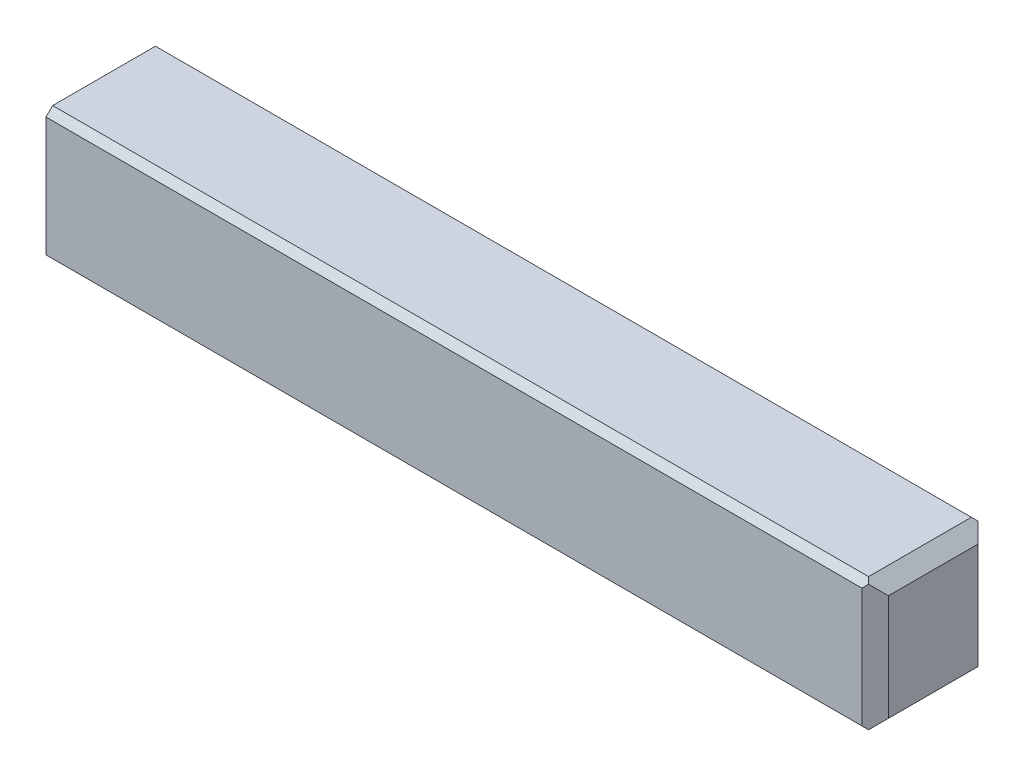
ISO-10303-21;
HEADER;
FILE_DESCRIPTION(('STEP AP214'),'2;1');
FILE_NAME('part.step','',(''),(''),'','','');
FILE_SCHEMA(('AUTOMOTIVE_DESIGN { 1 0 10303 214 1 1 1 1 }'));
ENDSEC;
DATA;
#1=APPLICATION_CONTEXT('core data for automotive mechanical design processes');
#2=APPLICATION_PROTOCOL_DEFINITION('international standard','automotive_design',2000,#1);
#3=PRODUCT_CONTEXT('',#1,'mechanical');
#4=PRODUCT('Part','Part','',(#3));
#5=PRODUCT_RELATED_PRODUCT_CATEGORY('part','',(#4));
#6=PRODUCT_DEFINITION_FORMATION('','',#4);
#7=PRODUCT_DEFINITION_CONTEXT('part definition',#1,'design');
#8=PRODUCT_DEFINITION('design','',#6,#7);
#9=PRODUCT_DEFINITION_SHAPE('','',#8);
#10=(LENGTH_UNIT() NAMED_UNIT(*) SI_UNIT(.MILLI.,.METRE.));
#11=(NAMED_UNIT(*) PLANE_ANGLE_UNIT() SI_UNIT($,.RADIAN.));
#12=(NAMED_UNIT(*) SI_UNIT($,.STERADIAN.) SOLID_ANGLE_UNIT());
#13=UNCERTAINTY_MEASURE_WITH_UNIT(LENGTH_MEASURE(1.E-05),#10,'distance_accuracy_value','');
#14=(GEOMETRIC_REPRESENTATION_CONTEXT(3) GLOBAL_UNCERTAINTY_ASSIGNED_CONTEXT((#13)) GLOBAL_UNIT_ASSIGNED_CONTEXT((#10,
#11,#12)) REPRESENTATION_CONTEXT('',''));
#15=CARTESIAN_POINT('',(0.,0.,0.));
#16=DIRECTION('',(0.,0.,1.));
#17=DIRECTION('',(1.,0.,0.));
#18=AXIS2_PLACEMENT_3D('',#15,#16,#17);
#19=CARTESIAN_POINT('',(-50.,3.6,-3.5));
#20=DIRECTION('',(0.,0.707106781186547,-0.707106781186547));
#21=DIRECTION('',(0.,0.707106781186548,0.707106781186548));
#22=AXIS2_PLACEMENT_3D('',#19,#20,#21);
#23=PLANE('',#22);
#24=DIRECTION('',(-0.577350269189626,0.577350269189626,0.577350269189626));
#25=VECTOR('',#24,1.);
#26=CARTESIAN_POINT('',(-16.9333333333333,20.1333333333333,13.0333333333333));
#27=LINE('',#26,#25);
#28=CARTESIAN_POINT('',(-0.800000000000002,4.,-3.1));
#29=VERTEX_POINT('',#28);
#30=CARTESIAN_POINT('',(-0.600000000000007,3.8,-3.29999999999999));
#31=VERTEX_POINT('',#30);
#32=EDGE_CURVE('E219',#29,#31,#27,.F.);
#33=ORIENTED_EDGE('',*,*,#32,.T.);
#34=DIRECTION('',(0.577350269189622,0.577350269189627,0.577350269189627));
#35=VECTOR('',#34,1.);
#36=CARTESIAN_POINT('',(-17.1999999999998,-12.8,-19.9));
#37=LINE('',#36,#35);
#38=CARTESIAN_POINT('',(-0.800000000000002,3.6,-3.5));
#39=VERTEX_POINT('',#38);
#40=EDGE_CURVE('E222',#31,#39,#37,.F.);
#41=ORIENTED_EDGE('',*,*,#40,.T.);
#42=DIRECTION('',(1.,0.,0.));
#43=VECTOR('',#42,1.);
#44=CARTESIAN_POINT('',(-50.,3.6,-3.5));
#45=LINE('',#44,#43);
#46=CARTESIAN_POINT('',(-50.,3.6,-3.5));
#47=VERTEX_POINT('',#46);
#48=EDGE_CURVE('E156',#47,#39,#45,.T.);
#49=ORIENTED_EDGE('',*,*,#48,.F.);
#50=DIRECTION('',(0.,0.707106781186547,0.707106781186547));
#51=VECTOR('',#50,1.);
#52=CARTESIAN_POINT('',(-50.,3.6,-3.5));
#53=LINE('',#52,#51);
#54=CARTESIAN_POINT('',(-50.,4.,-3.1));
#55=VERTEX_POINT('',#54);
#56=EDGE_CURVE('E148',#47,#55,#53,.T.);
#57=ORIENTED_EDGE('',*,*,#56,.T.);
#58=DIRECTION('',(1.,0.,0.));
#59=VECTOR('',#58,1.);
#60=CARTESIAN_POINT('',(-50.,4.,-3.1));
#61=LINE('',#60,#59);
#62=EDGE_CURVE('E131',#55,#29,#61,.T.);
#63=ORIENTED_EDGE('',*,*,#62,.T.);
#64=EDGE_LOOP('',(#33,#41,#49,#57,#63));
#65=FACE_BOUND('',#64,.T.);
#66=ADVANCED_FACE('F40',(#65),#23,.T.);
#67=CARTESIAN_POINT('',(-50.,-3.6,-3.5));
#68=DIRECTION('',(0.,0.,-1.));
#69=DIRECTION('',(-1.,0.,0.));
#70=AXIS2_PLACEMENT_3D('',#67,#68,#69);
#71=PLANE('',#70);
#72=ORIENTED_EDGE('',*,*,#48,.T.);
#73=DIRECTION('',(0.,-1.,0.));
#74=VECTOR('',#73,1.);
#75=CARTESIAN_POINT('',(-0.800000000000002,-3.6,-3.5));
#76=LINE('',#75,#74);
#77=CARTESIAN_POINT('',(-0.800000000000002,-3.6,-3.5));
#78=VERTEX_POINT('',#77);
#79=EDGE_CURVE('E225',#39,#78,#76,.T.);
#80=ORIENTED_EDGE('',*,*,#79,.T.);
#81=DIRECTION('',(1.,0.,0.));
#82=VECTOR('',#81,1.);
#83=CARTESIAN_POINT('',(-50.,-3.6,-3.5));
#84=LINE('',#83,#82);
#85=CARTESIAN_POINT('',(-50.,-3.6,-3.5));
#86=VERTEX_POINT('',#85);
#87=EDGE_CURVE('E186',#86,#78,#84,.T.);
#88=ORIENTED_EDGE('',*,*,#87,.F.);
#89=DIRECTION('',(0.,1.,0.));
#90=VECTOR('',#89,1.);
#91=CARTESIAN_POINT('',(-50.,-3.6,-3.5));
#92=LINE('',#91,#90);
#93=EDGE_CURVE('E141',#86,#47,#92,.T.);
#94=ORIENTED_EDGE('',*,*,#93,.T.);
#95=EDGE_LOOP('',(#72,#80,#88,#94));
#96=FACE_BOUND('',#95,.T.);
#97=ADVANCED_FACE('F278',(#96),#71,.T.);
#98=CARTESIAN_POINT('',(-50.,-4.,-3.1));
#99=DIRECTION('',(0.,-0.707106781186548,-0.707106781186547));
#100=DIRECTION('',(0.,0.707106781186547,-0.707106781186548));
#101=AXIS2_PLACEMENT_3D('',#98,#99,#100);
#102=PLANE('',#101);
#103=ORIENTED_EDGE('',*,*,#87,.T.);
#104=DIRECTION('',(-0.577350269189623,0.577350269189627,-0.577350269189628));
#105=VECTOR('',#104,1.);
#106=CARTESIAN_POINT('',(-16.9333333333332,12.5333333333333,-19.6333333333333));
#107=LINE('',#106,#105);
#108=CARTESIAN_POINT('',(-0.600000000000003,-3.8,-3.29999999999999));
#109=VERTEX_POINT('',#108);
#110=EDGE_CURVE('E232',#78,#109,#107,.F.);
#111=ORIENTED_EDGE('',*,*,#110,.T.);
#112=DIRECTION('',(0.577350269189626,0.577350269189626,-0.577350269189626));
#113=VECTOR('',#112,1.);
#114=CARTESIAN_POINT('',(-17.2,-20.4,13.3));
#115=LINE('',#114,#113);
#116=CARTESIAN_POINT('',(-0.800000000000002,-4.,-3.1));
#117=VERTEX_POINT('',#116);
#118=EDGE_CURVE('E229',#109,#117,#115,.F.);
#119=ORIENTED_EDGE('',*,*,#118,.T.);
#120=DIRECTION('',(1.,0.,0.));
#121=VECTOR('',#120,1.);
#122=CARTESIAN_POINT('',(-50.,-4.,-3.1));
#123=LINE('',#122,#121);
#124=CARTESIAN_POINT('',(-50.,-4.,-3.1));
#125=VERTEX_POINT('',#124);
#126=EDGE_CURVE('E190',#125,#117,#123,.T.);
#127=ORIENTED_EDGE('',*,*,#126,.F.);
#128=DIRECTION('',(0.,0.707106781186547,-0.707106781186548));
#129=VECTOR('',#128,1.);
#130=CARTESIAN_POINT('',(-50.,-4.,-3.1));
#131=LINE('',#130,#129);
#132=EDGE_CURVE('E177',#125,#86,#131,.T.);
#133=ORIENTED_EDGE('',*,*,#132,.T.);
#134=EDGE_LOOP('',(#103,#111,#119,#127,#133));
#135=FACE_BOUND('',#134,.T.);
#136=ADVANCED_FACE('F281',(#135),#102,.T.);
#137=CARTESIAN_POINT('',(-50.,-4.,3.1));
#138=DIRECTION('',(0.,-1.,0.));
#139=DIRECTION('',(0.,0.,-1.));
#140=AXIS2_PLACEMENT_3D('',#137,#138,#139);
#141=PLANE('',#140);
#142=ORIENTED_EDGE('',*,*,#126,.T.);
#143=DIRECTION('',(0.,0.,1.));
#144=VECTOR('',#143,1.);
#145=CARTESIAN_POINT('',(-0.800000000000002,-4.,3.1));
#146=LINE('',#145,#144);
#147=CARTESIAN_POINT('',(-0.800000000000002,-4.,3.1));
#148=VERTEX_POINT('',#147);
#149=EDGE_CURVE('E235',#117,#148,#146,.T.);
#150=ORIENTED_EDGE('',*,*,#149,.T.);
#151=DIRECTION('',(1.,0.,0.));
#152=VECTOR('',#151,1.);
#153=CARTESIAN_POINT('',(-50.,-4.,3.1));
#154=LINE('',#153,#152);
#155=CARTESIAN_POINT('',(-50.,-4.,3.1));
#156=VERTEX_POINT('',#155);
#157=EDGE_CURVE('E194',#156,#148,#154,.T.);
#158=ORIENTED_EDGE('',*,*,#157,.F.);
#159=DIRECTION('',(0.,0.,-1.));
#160=VECTOR('',#159,1.);
#161=CARTESIAN_POINT('',(-50.,-4.,3.1));
#162=LINE('',#161,#160);
#163=EDGE_CURVE('E173',#156,#125,#162,.T.);
#164=ORIENTED_EDGE('',*,*,#163,.T.);
#165=EDGE_LOOP('',(#142,#150,#158,#164));
#166=FACE_BOUND('',#165,.T.);
#167=ADVANCED_FACE('F287',(#166),#141,.T.);
#168=CARTESIAN_POINT('',(-50.,-3.6,3.5));
#169=DIRECTION('',(0.,-0.707106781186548,0.707106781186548));
#170=DIRECTION('',(0.,-0.707106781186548,-0.707106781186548));
#171=AXIS2_PLACEMENT_3D('',#168,#169,#170);
#172=PLANE('',#171);
#173=ORIENTED_EDGE('',*,*,#157,.T.);
#174=DIRECTION('',(-0.577350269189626,-0.577350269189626,-0.577350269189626));
#175=VECTOR('',#174,1.);
#176=CARTESIAN_POINT('',(-16.9333333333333,-20.1333333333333,-13.0333333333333));
#177=LINE('',#176,#175);
#178=CARTESIAN_POINT('',(-0.600000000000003,-3.8,3.3));
#179=VERTEX_POINT('',#178);
#180=EDGE_CURVE('E241',#148,#179,#177,.F.);
#181=ORIENTED_EDGE('',*,*,#180,.T.);
#182=DIRECTION('',(0.577350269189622,-0.577350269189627,-0.577350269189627));
#183=VECTOR('',#182,1.);
#184=CARTESIAN_POINT('',(-17.1999999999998,12.8,19.9));
#185=LINE('',#184,#183);
#186=CARTESIAN_POINT('',(-0.800000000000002,-3.6,3.5));
#187=VERTEX_POINT('',#186);
#188=EDGE_CURVE('E238',#179,#187,#185,.F.);
#189=ORIENTED_EDGE('',*,*,#188,.T.);
#190=DIRECTION('',(1.,0.,0.));
#191=VECTOR('',#190,1.);
#192=CARTESIAN_POINT('',(-50.,-3.6,3.5));
#193=LINE('',#192,#191);
#194=CARTESIAN_POINT('',(-50.,-3.6,3.5));
#195=VERTEX_POINT('',#194);
#196=EDGE_CURVE('E198',#195,#187,#193,.T.);
#197=ORIENTED_EDGE('',*,*,#196,.F.);
#198=DIRECTION('',(0.,-0.707106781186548,-0.707106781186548));
#199=VECTOR('',#198,1.);
#200=CARTESIAN_POINT('',(-50.,-3.6,3.5));
#201=LINE('',#200,#199);
#202=EDGE_CURVE('E169',#195,#156,#201,.T.);
#203=ORIENTED_EDGE('',*,*,#202,.T.);
#204=EDGE_LOOP('',(#173,#181,#189,#197,#203));
#205=FACE_BOUND('',#204,.T.);
#206=ADVANCED_FACE('F290',(#205),#172,.T.);
#207=CARTESIAN_POINT('',(-50.,3.6,3.5));
#208=DIRECTION('',(0.,0.,1.));
#209=DIRECTION('',(1.,0.,0.));
#210=AXIS2_PLACEMENT_3D('',#207,#208,#209);
#211=PLANE('',#210);
#212=ORIENTED_EDGE('',*,*,#196,.T.);
#213=DIRECTION('',(0.,1.,0.));
#214=VECTOR('',#213,1.);
#215=CARTESIAN_POINT('',(-0.800000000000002,3.6,3.5));
#216=LINE('',#215,#214);
#217=CARTESIAN_POINT('',(-0.800000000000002,3.6,3.5));
#218=VERTEX_POINT('',#217);
#219=EDGE_CURVE('E244',#187,#218,#216,.T.);
#220=ORIENTED_EDGE('',*,*,#219,.T.);
#221=DIRECTION('',(1.,0.,0.));
#222=VECTOR('',#221,1.);
#223=CARTESIAN_POINT('',(-50.,3.6,3.5));
#224=LINE('',#223,#222);
#225=CARTESIAN_POINT('',(-50.,3.6,3.5));
#226=VERTEX_POINT('',#225);
#227=EDGE_CURVE('E202',#226,#218,#224,.T.);
#228=ORIENTED_EDGE('',*,*,#227,.F.);
#229=DIRECTION('',(0.,-1.,0.));
#230=VECTOR('',#229,1.);
#231=CARTESIAN_POINT('',(-50.,3.6,3.5));
#232=LINE('',#231,#230);
#233=EDGE_CURVE('E165',#226,#195,#232,.T.);
#234=ORIENTED_EDGE('',*,*,#233,.T.);
#235=EDGE_LOOP('',(#212,#220,#228,#234));
#236=FACE_BOUND('',#235,.T.);
#237=ADVANCED_FACE('F294',(#236),#211,.T.);
#238=CARTESIAN_POINT('',(-50.,4.,3.1));
#239=DIRECTION('',(0.,0.707106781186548,0.707106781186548));
#240=DIRECTION('',(0.,-0.707106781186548,0.707106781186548));
#241=AXIS2_PLACEMENT_3D('',#238,#239,#240);
#242=PLANE('',#241);
#243=ORIENTED_EDGE('',*,*,#227,.T.);
#244=DIRECTION('',(-0.577350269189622,-0.577350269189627,0.577350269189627));
#245=VECTOR('',#244,1.);
#246=CARTESIAN_POINT('',(-16.9333333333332,-12.5333333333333,19.6333333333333));
#247=LINE('',#246,#245);
#248=CARTESIAN_POINT('',(-0.600000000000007,3.8,3.3));
#249=VERTEX_POINT('',#248);
#250=EDGE_CURVE('E51',#218,#249,#247,.F.);
#251=ORIENTED_EDGE('',*,*,#250,.T.);
#252=DIRECTION('',(0.577350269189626,-0.577350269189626,0.577350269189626));
#253=VECTOR('',#252,1.);
#254=CARTESIAN_POINT('',(-17.2,20.4,-13.3));
#255=LINE('',#254,#253);
#256=CARTESIAN_POINT('',(-0.800000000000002,4.,3.1));
#257=VERTEX_POINT('',#256);
#258=EDGE_CURVE('E63',#249,#257,#255,.F.);
#259=ORIENTED_EDGE('',*,*,#258,.T.);
#260=DIRECTION('',(1.,0.,0.));
#261=VECTOR('',#260,1.);
#262=CARTESIAN_POINT('',(-50.,4.,3.1));
#263=LINE('',#262,#261);
#264=CARTESIAN_POINT('',(-50.,4.,3.1));
#265=VERTEX_POINT('',#264);
#266=EDGE_CURVE('E140',#265,#257,#263,.T.);
#267=ORIENTED_EDGE('',*,*,#266,.F.);
#268=DIRECTION('',(0.,-0.707106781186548,0.707106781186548));
#269=VECTOR('',#268,1.);
#270=CARTESIAN_POINT('',(-50.,4.,3.1));
#271=LINE('',#270,#269);
#272=EDGE_CURVE('E152',#265,#226,#271,.T.);
#273=ORIENTED_EDGE('',*,*,#272,.T.);
#274=EDGE_LOOP('',(#243,#251,#259,#267,#273));
#275=FACE_BOUND('',#274,.T.);
#276=ADVANCED_FACE('F295',(#275),#242,.T.);
#277=CARTESIAN_POINT('',(-50.,4.,-3.1));
#278=DIRECTION('',(0.,1.,0.));
#279=DIRECTION('',(0.,0.,1.));
#280=AXIS2_PLACEMENT_3D('',#277,#278,#279);
#281=PLANE('',#280);
#282=ORIENTED_EDGE('',*,*,#266,.T.);
#283=DIRECTION('',(0.,0.,-1.));
#284=VECTOR('',#283,1.);
#285=CARTESIAN_POINT('',(-0.800000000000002,4.,-3.1));
#286=LINE('',#285,#284);
#287=EDGE_CURVE('E11',#257,#29,#286,.T.);
#288=ORIENTED_EDGE('',*,*,#287,.T.);
#289=ORIENTED_EDGE('',*,*,#62,.F.);
#290=DIRECTION('',(0.,0.,1.));
#291=VECTOR('',#290,1.);
#292=CARTESIAN_POINT('',(-50.,4.,-3.1));
#293=LINE('',#292,#291);
#294=EDGE_CURVE('E134',#55,#265,#293,.T.);
#295=ORIENTED_EDGE('',*,*,#294,.T.);
#296=EDGE_LOOP('',(#282,#288,#289,#295));
#297=FACE_BOUND('',#296,.T.);
#298=ADVANCED_FACE('F133',(#297),#281,.T.);
#299=CARTESIAN_POINT('',(-50.,0.,0.));
#300=DIRECTION('',(1.,0.,0.));
#301=DIRECTION('',(0.,0.,-1.));
#302=AXIS2_PLACEMENT_3D('',#299,#300,#301);
#303=PLANE('',#302);
#304=ORIENTED_EDGE('',*,*,#56,.F.);
#305=ORIENTED_EDGE('',*,*,#93,.F.);
#306=ORIENTED_EDGE('',*,*,#132,.F.);
#307=ORIENTED_EDGE('',*,*,#163,.F.);
#308=ORIENTED_EDGE('',*,*,#202,.F.);
#309=ORIENTED_EDGE('',*,*,#233,.F.);
#310=ORIENTED_EDGE('',*,*,#272,.F.);
#311=ORIENTED_EDGE('',*,*,#294,.F.);
#312=EDGE_LOOP('',(#304,#305,#306,#307,#308,#309,#310,#311));
#313=FACE_BOUND('',#312,.T.);
#314=ADVANCED_FACE('F146',(#313),#303,.F.);
#315=CARTESIAN_POINT('',(0.,0.,0.));
#316=DIRECTION('',(1.,0.,0.));
#317=DIRECTION('',(0.,0.,-1.));
#318=AXIS2_PLACEMENT_3D('',#315,#316,#317);
#319=PLANE('',#318);
#320=DIRECTION('',(0.,0.,-1.));
#321=VECTOR('',#320,1.);
#322=CARTESIAN_POINT('',(0.,-3.2,0.));
#323=LINE('',#322,#321);
#324=CARTESIAN_POINT('',(0.,-3.2,2.69999999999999));
#325=VERTEX_POINT('',#324);
#326=CARTESIAN_POINT('',(0.,-3.2,-2.69999999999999));
#327=VERTEX_POINT('',#326);
#328=EDGE_CURVE('E212',#325,#327,#323,.T.);
#329=ORIENTED_EDGE('',*,*,#328,.T.);
#330=DIRECTION('',(0.,1.,0.));
#331=VECTOR('',#330,1.);
#332=CARTESIAN_POINT('',(0.,0.,-2.69999999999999));
#333=LINE('',#332,#331);
#334=CARTESIAN_POINT('',(0.,3.2,-2.69999999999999));
#335=VERTEX_POINT('',#334);
#336=EDGE_CURVE('E215',#327,#335,#333,.T.);
#337=ORIENTED_EDGE('',*,*,#336,.T.);
#338=DIRECTION('',(0.,0.,1.));
#339=VECTOR('',#338,1.);
#340=CARTESIAN_POINT('',(0.,3.2,0.));
#341=LINE('',#340,#339);
#342=CARTESIAN_POINT('',(0.,3.2,2.69999999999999));
#343=VERTEX_POINT('',#342);
#344=EDGE_CURVE('E185',#335,#343,#341,.T.);
#345=ORIENTED_EDGE('',*,*,#344,.T.);
#346=DIRECTION('',(0.,-1.,0.));
#347=VECTOR('',#346,1.);
#348=CARTESIAN_POINT('',(0.,0.,2.69999999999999));
#349=LINE('',#348,#347);
#350=EDGE_CURVE('E209',#343,#325,#349,.T.);
#351=ORIENTED_EDGE('',*,*,#350,.T.);
#352=EDGE_LOOP('',(#329,#337,#345,#351));
#353=FACE_BOUND('',#352,.T.);
#354=ADVANCED_FACE('F270',(#353),#319,.T.);
#355=CARTESIAN_POINT('',(0.,0.,2.69999999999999));
#356=DIRECTION('',(-0.707106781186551,0.,-0.707106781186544));
#357=DIRECTION('',(0.,-1.,0.));
#358=AXIS2_PLACEMENT_3D('',#355,#356,#357);
#359=PLANE('',#358);
#360=ORIENTED_EDGE('',*,*,#219,.F.);
#361=ORIENTED_EDGE('',*,*,#188,.F.);
#362=DIRECTION('',(-0.577350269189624,-0.577350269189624,0.577350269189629));
#363=VECTOR('',#362,1.);
#364=CARTESIAN_POINT('',(0.9,-2.3,1.79999999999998));
#365=LINE('',#364,#363);
#366=EDGE_CURVE('E45',#325,#179,#365,.T.);
#367=ORIENTED_EDGE('',*,*,#366,.F.);
#368=ORIENTED_EDGE('',*,*,#350,.F.);
#369=DIRECTION('',(-0.577350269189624,0.577350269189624,0.577350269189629));
#370=VECTOR('',#369,1.);
#371=CARTESIAN_POINT('',(1.06666666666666,2.13333333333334,1.63333333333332));
#372=LINE('',#371,#370);
#373=EDGE_CURVE('E161',#249,#343,#372,.F.);
#374=ORIENTED_EDGE('',*,*,#373,.F.);
#375=ORIENTED_EDGE('',*,*,#250,.F.);
#376=EDGE_LOOP('',(#360,#361,#367,#368,#374,#375));
#377=FACE_BOUND('',#376,.T.);
#378=ADVANCED_FACE('F43',(#377),#359,.F.);
#379=CARTESIAN_POINT('',(0.,-3.2,0.));
#380=DIRECTION('',(-0.707106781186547,0.707106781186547,0.));
#381=DIRECTION('',(0.,0.,-1.));
#382=AXIS2_PLACEMENT_3D('',#379,#380,#381);
#383=PLANE('',#382);
#384=ORIENTED_EDGE('',*,*,#149,.F.);
#385=ORIENTED_EDGE('',*,*,#118,.F.);
#386=DIRECTION('',(-0.577350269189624,-0.577350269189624,-0.577350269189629));
#387=VECTOR('',#386,1.);
#388=CARTESIAN_POINT('',(1.06666666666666,-2.13333333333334,-1.63333333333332));
#389=LINE('',#388,#387);
#390=EDGE_CURVE('E254',#327,#109,#389,.T.);
#391=ORIENTED_EDGE('',*,*,#390,.F.);
#392=ORIENTED_EDGE('',*,*,#328,.F.);
#393=ORIENTED_EDGE('',*,*,#366,.T.);
#394=ORIENTED_EDGE('',*,*,#180,.F.);
#395=EDGE_LOOP('',(#384,#385,#391,#392,#393,#394));
#396=FACE_BOUND('',#395,.T.);
#397=ADVANCED_FACE('F284',(#396),#383,.F.);
#398=CARTESIAN_POINT('',(0.,3.2,0.));
#399=DIRECTION('',(-0.707106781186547,-0.707106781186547,0.));
#400=DIRECTION('',(0.,0.,1.));
#401=AXIS2_PLACEMENT_3D('',#398,#399,#400);
#402=PLANE('',#401);
#403=ORIENTED_EDGE('',*,*,#373,.T.);
#404=ORIENTED_EDGE('',*,*,#344,.F.);
#405=DIRECTION('',(-0.577350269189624,0.577350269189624,-0.577350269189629));
#406=VECTOR('',#405,1.);
#407=CARTESIAN_POINT('',(0.9,2.3,-1.79999999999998));
#408=LINE('',#407,#406);
#409=EDGE_CURVE('E251',#31,#335,#408,.F.);
#410=ORIENTED_EDGE('',*,*,#409,.F.);
#411=ORIENTED_EDGE('',*,*,#32,.F.);
#412=ORIENTED_EDGE('',*,*,#287,.F.);
#413=ORIENTED_EDGE('',*,*,#258,.F.);
#414=EDGE_LOOP('',(#403,#404,#410,#411,#412,#413));
#415=FACE_BOUND('',#414,.T.);
#416=ADVANCED_FACE('F261',(#415),#402,.F.);
#417=CARTESIAN_POINT('',(0.,0.,-2.69999999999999));
#418=DIRECTION('',(-0.707106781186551,0.,0.707106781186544));
#419=DIRECTION('',(0.,1.,0.));
#420=AXIS2_PLACEMENT_3D('',#417,#418,#419);
#421=PLANE('',#420);
#422=ORIENTED_EDGE('',*,*,#110,.F.);
#423=ORIENTED_EDGE('',*,*,#79,.F.);
#424=ORIENTED_EDGE('',*,*,#40,.F.);
#425=ORIENTED_EDGE('',*,*,#409,.T.);
#426=ORIENTED_EDGE('',*,*,#336,.F.);
#427=ORIENTED_EDGE('',*,*,#390,.T.);
#428=EDGE_LOOP('',(#422,#423,#424,#425,#426,#427));
#429=FACE_BOUND('',#428,.T.);
#430=ADVANCED_FACE('F274',(#429),#421,.F.);
#431=CLOSED_SHELL('',(#66,#97,#136,#167,#206,#237,#276,#298,#314,#354,#378,#397,#416,#430));
#432=MANIFOLD_SOLID_BREP('B2',#431);
#433=ADVANCED_BREP_SHAPE_REPRESENTATION('',(#18,#432),#14);
#434=SHAPE_DEFINITION_REPRESENTATION(#9,#433);
ENDSEC;
END-ISO-10303-21;
